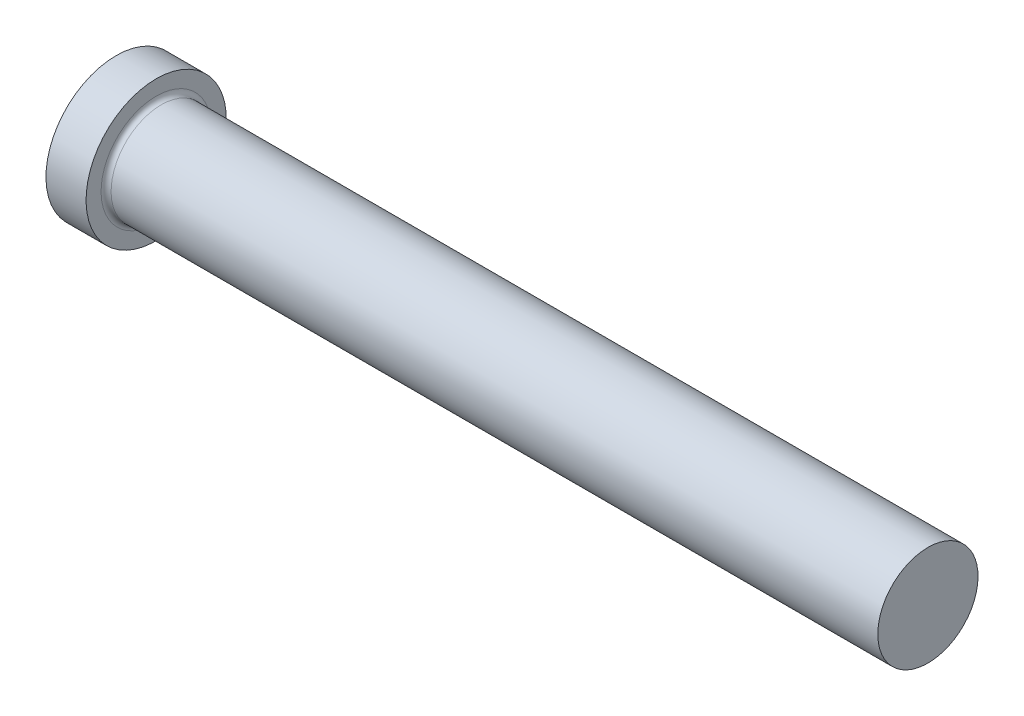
from build123d import *


with BuildPart() as part:
    # Sketch1 → Base-Revolve (revolve)
    with BuildSketch(Plane.XY):
        with BuildLine():
            Line((-6.35, 0), (-6.35, 11.1125))
            Line((-6.35, 11.1125), (0, 11.1125))
            Line((0, 11.1125), (0, 8.73125))
            ThreePointArc((0, 8.73125), (0.232483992, 8.169983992), (0.79375, 7.9375))
            Line((0.79375, 7.9375), (122.2375, 7.9375))
            Line((122.2375, 7.9375), (122.2375, 0))
            Line((122.2375, 0), (-6.35, 0))
        make_face()
    revolve(axis=Axis((122.2375, 0, 0), (-1, 0, 0)))


solid = part.part
